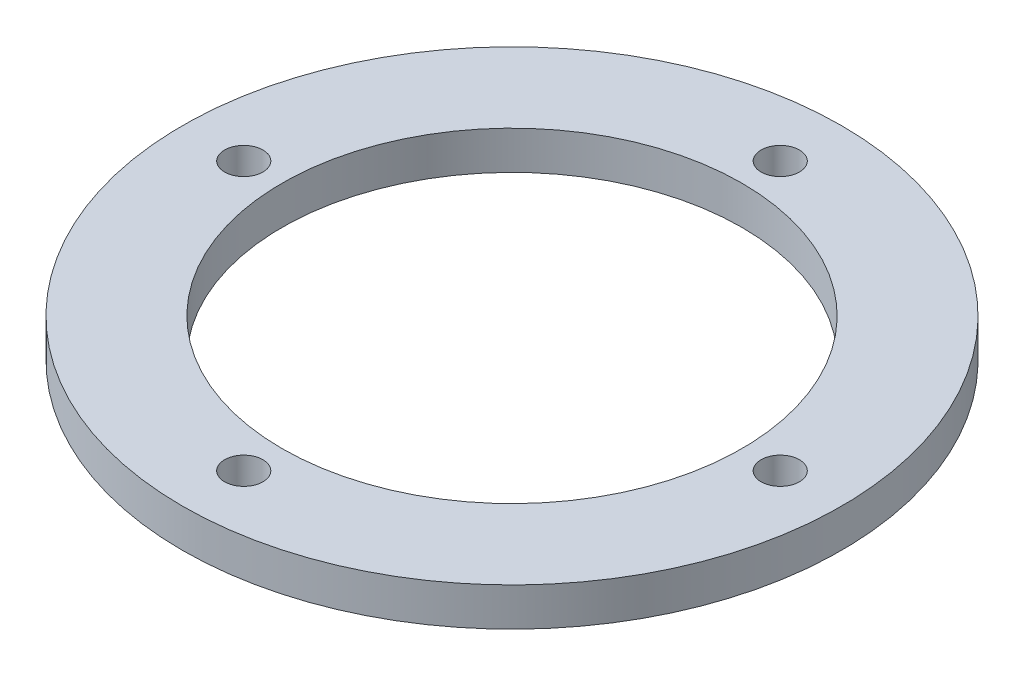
from build123d import *

# Parameters (mm, degrees)
SKETCH1_R           = 43
SKETCH1_R_2         = 2.5
SKETCH1_R_3         = 30
BOSS_EXTRUDE1_DEPTH = 5


with BuildPart() as part:
    # Sketch1 → Boss-Extrude1 (new body)
    with BuildSketch(Plane(origin=(0, 0, 0), x_dir=(1, 0, 0), z_dir=(0, 1, 0))):
        with Locations(Location((0, 0, 0), (0, 0, 270))):
            Circle(SKETCH1_R)
        with Locations(Location((-35, 0, 0), (0, 0, 270))):
            Circle(SKETCH1_R_2, mode=Mode.SUBTRACT)
        with Locations(Location((0, 35, 0), (0, 0, 270))):
            Circle(SKETCH1_R_2, mode=Mode.SUBTRACT)
        with Locations(Location((35, 0, 0), (0, 0, 270))):
            Circle(SKETCH1_R_2, mode=Mode.SUBTRACT)
        with Locations(Location((0, -35, 0), (0, 0, 270))):
            Circle(SKETCH1_R_2, mode=Mode.SUBTRACT)
        with Locations(Location((0, 0, 0), (0, 0, 270))):
            Circle(SKETCH1_R_3, mode=Mode.SUBTRACT)
    extrude(amount=BOSS_EXTRUDE1_DEPTH)


solid = part.part
